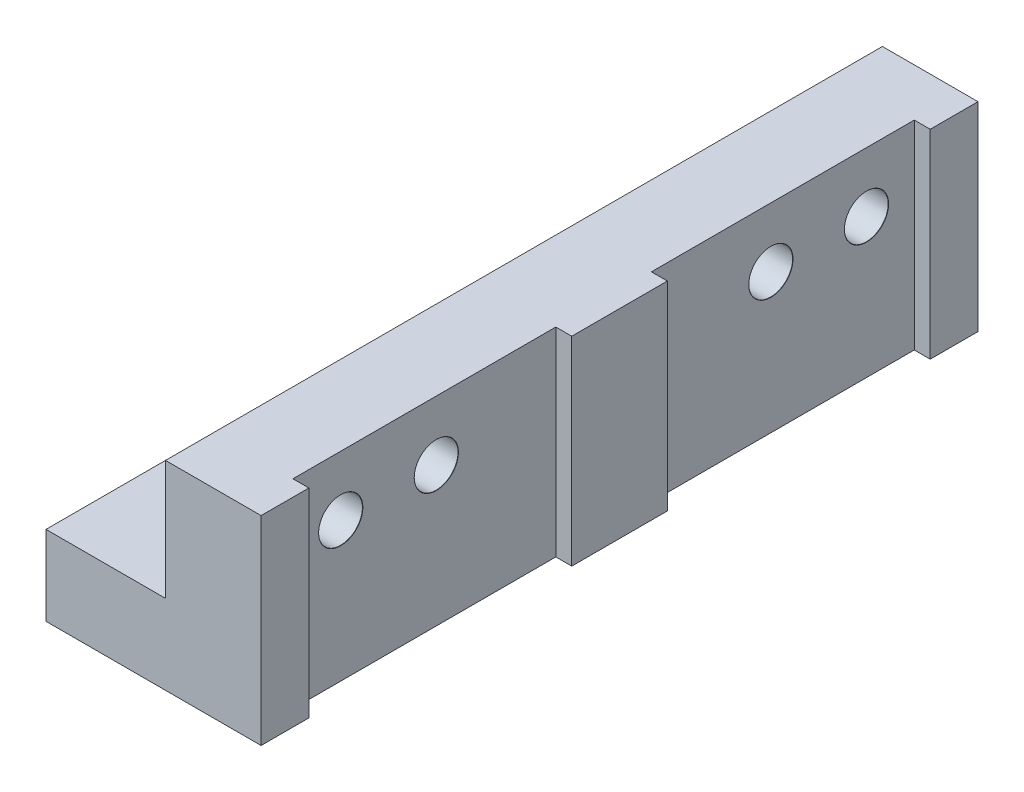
ISO-10303-21;
HEADER;
FILE_DESCRIPTION(('STEP AP214'),'2;1');
FILE_NAME('part.step','',(''),(''),'','','');
FILE_SCHEMA(('AUTOMOTIVE_DESIGN { 1 0 10303 214 1 1 1 1 }'));
ENDSEC;
DATA;
#1=APPLICATION_CONTEXT('core data for automotive mechanical design processes');
#2=APPLICATION_PROTOCOL_DEFINITION('international standard','automotive_design',2000,#1);
#3=PRODUCT_CONTEXT('',#1,'mechanical');
#4=PRODUCT('Part','Part','',(#3));
#5=PRODUCT_RELATED_PRODUCT_CATEGORY('part','',(#4));
#6=PRODUCT_DEFINITION_FORMATION('','',#4);
#7=PRODUCT_DEFINITION_CONTEXT('part definition',#1,'design');
#8=PRODUCT_DEFINITION('design','',#6,#7);
#9=PRODUCT_DEFINITION_SHAPE('','',#8);
#10=(LENGTH_UNIT() NAMED_UNIT(*) SI_UNIT(.MILLI.,.METRE.));
#11=(NAMED_UNIT(*) PLANE_ANGLE_UNIT() SI_UNIT($,.RADIAN.));
#12=(NAMED_UNIT(*) SI_UNIT($,.STERADIAN.) SOLID_ANGLE_UNIT());
#13=UNCERTAINTY_MEASURE_WITH_UNIT(LENGTH_MEASURE(1.E-05),#10,'distance_accuracy_value','');
#14=(GEOMETRIC_REPRESENTATION_CONTEXT(3) GLOBAL_UNCERTAINTY_ASSIGNED_CONTEXT((#13)) GLOBAL_UNIT_ASSIGNED_CONTEXT((#10,
#11,#12)) REPRESENTATION_CONTEXT('',''));
#15=CARTESIAN_POINT('',(0.,0.,0.));
#16=DIRECTION('',(0.,0.,1.));
#17=DIRECTION('',(1.,0.,0.));
#18=AXIS2_PLACEMENT_3D('',#15,#16,#17);
#19=CARTESIAN_POINT('',(148.,0.,-90.));
#20=DIRECTION('',(1.,0.,0.));
#21=DIRECTION('',(0.,0.,-1.));
#22=AXIS2_PLACEMENT_3D('',#19,#20,#21);
#23=PLANE('',#22);
#24=CARTESIAN_POINT('',(148.,17.5,-78.));
#25=DIRECTION('',(-1.,0.,0.));
#26=DIRECTION('',(0.,0.,1.));
#27=AXIS2_PLACEMENT_3D('',#24,#25,#26);
#28=CIRCLE('',#27,2.775);
#29=CARTESIAN_POINT('',(148.,17.5,-75.225));
#30=VERTEX_POINT('',#29);
#31=EDGE_CURVE('E268',#30,#30,#28,.T.);
#32=ORIENTED_EDGE('',*,*,#31,.T.);
#33=EDGE_LOOP('',(#32));
#34=FACE_BOUND('',#33,.T.);
#35=CARTESIAN_POINT('',(148.,17.5,-66.));
#36=DIRECTION('',(-1.,0.,0.));
#37=DIRECTION('',(0.,0.,1.));
#38=AXIS2_PLACEMENT_3D('',#35,#36,#37);
#39=CIRCLE('',#38,2.775);
#40=CARTESIAN_POINT('',(148.,17.5,-63.225));
#41=VERTEX_POINT('',#40);
#42=EDGE_CURVE('E271',#41,#41,#39,.T.);
#43=ORIENTED_EDGE('',*,*,#42,.T.);
#44=EDGE_LOOP('',(#43));
#45=FACE_BOUND('',#44,.T.);
#46=DIRECTION('',(0.,1.,0.));
#47=VECTOR('',#46,1.);
#48=CARTESIAN_POINT('',(148.,0.,-51.));
#49=LINE('',#48,#47);
#50=CARTESIAN_POINT('',(148.,0.,-51.));
#51=VERTEX_POINT('',#50);
#52=CARTESIAN_POINT('',(148.,25.,-51.));
#53=VERTEX_POINT('',#52);
#54=EDGE_CURVE('E40',#51,#53,#49,.T.);
#55=ORIENTED_EDGE('',*,*,#54,.F.);
#56=DIRECTION('',(0.,0.,1.));
#57=VECTOR('',#56,1.);
#58=CARTESIAN_POINT('',(148.,0.,-90.));
#59=LINE('',#58,#57);
#60=CARTESIAN_POINT('',(148.,0.,-84.));
#61=VERTEX_POINT('',#60);
#62=EDGE_CURVE('E11',#61,#51,#59,.T.);
#63=ORIENTED_EDGE('',*,*,#62,.F.);
#64=DIRECTION('',(0.,1.,0.));
#65=VECTOR('',#64,1.);
#66=CARTESIAN_POINT('',(148.,0.,-84.));
#67=LINE('',#66,#65);
#68=CARTESIAN_POINT('',(148.,25.,-84.));
#69=VERTEX_POINT('',#68);
#70=EDGE_CURVE('E187',#61,#69,#67,.T.);
#71=ORIENTED_EDGE('',*,*,#70,.T.);
#72=DIRECTION('',(0.,0.,1.));
#73=VECTOR('',#72,1.);
#74=CARTESIAN_POINT('',(148.,25.,-90.));
#75=LINE('',#74,#73);
#76=EDGE_CURVE('E213',#69,#53,#75,.T.);
#77=ORIENTED_EDGE('',*,*,#76,.T.);
#78=EDGE_LOOP('',(#55,#63,#71,#77));
#79=FACE_BOUND('',#78,.T.);
#80=ADVANCED_FACE('F16',(#34,#45,#79),#23,.T.);
#81=CARTESIAN_POINT('',(148.,17.5,-12.));
#82=DIRECTION('',(-1.,0.,0.));
#83=DIRECTION('',(0.,0.,1.));
#84=AXIS2_PLACEMENT_3D('',#81,#82,#83);
#85=CIRCLE('',#84,2.775);
#86=CARTESIAN_POINT('',(148.,17.5,-9.225));
#87=VERTEX_POINT('',#86);
#88=EDGE_CURVE('E298',#87,#87,#85,.T.);
#89=ORIENTED_EDGE('',*,*,#88,.T.);
#90=EDGE_LOOP('',(#89));
#91=FACE_BOUND('',#90,.T.);
#92=CARTESIAN_POINT('',(148.,17.5,-24.));
#93=DIRECTION('',(-1.,0.,0.));
#94=DIRECTION('',(0.,0.,1.));
#95=AXIS2_PLACEMENT_3D('',#92,#93,#94);
#96=CIRCLE('',#95,2.775);
#97=CARTESIAN_POINT('',(148.,17.5,-21.225));
#98=VERTEX_POINT('',#97);
#99=EDGE_CURVE('E319',#98,#98,#96,.T.);
#100=ORIENTED_EDGE('',*,*,#99,.T.);
#101=EDGE_LOOP('',(#100));
#102=FACE_BOUND('',#101,.T.);
#103=DIRECTION('',(0.,1.,0.));
#104=VECTOR('',#103,1.);
#105=CARTESIAN_POINT('',(148.,0.,-6.));
#106=LINE('',#105,#104);
#107=CARTESIAN_POINT('',(148.,0.,-6.));
#108=VERTEX_POINT('',#107);
#109=CARTESIAN_POINT('',(148.,25.,-6.));
#110=VERTEX_POINT('',#109);
#111=EDGE_CURVE('E155',#108,#110,#106,.T.);
#112=ORIENTED_EDGE('',*,*,#111,.F.);
#113=CARTESIAN_POINT('',(148.,0.,-39.));
#114=VERTEX_POINT('',#113);
#115=EDGE_CURVE('E20',#114,#108,#59,.T.);
#116=ORIENTED_EDGE('',*,*,#115,.F.);
#117=DIRECTION('',(0.,1.,0.));
#118=VECTOR('',#117,1.);
#119=CARTESIAN_POINT('',(148.,0.,-39.));
#120=LINE('',#119,#118);
#121=CARTESIAN_POINT('',(148.,25.,-39.));
#122=VERTEX_POINT('',#121);
#123=EDGE_CURVE('E169',#114,#122,#120,.T.);
#124=ORIENTED_EDGE('',*,*,#123,.T.);
#125=EDGE_CURVE('E210',#122,#110,#75,.T.);
#126=ORIENTED_EDGE('',*,*,#125,.T.);
#127=EDGE_LOOP('',(#112,#116,#124,#126));
#128=FACE_BOUND('',#127,.T.);
#129=ADVANCED_FACE('F18',(#91,#102,#128),#23,.T.);
#130=CARTESIAN_POINT('',(148.,0.,-90.));
#131=DIRECTION('',(0.,-1.,0.));
#132=DIRECTION('',(1.,0.,0.));
#133=AXIS2_PLACEMENT_3D('',#130,#131,#132);
#134=PLANE('',#133);
#135=CARTESIAN_POINT('',(130.5,0.,-70.));
#136=DIRECTION('',(0.,1.,0.));
#137=DIRECTION('',(0.,0.,1.));
#138=AXIS2_PLACEMENT_3D('',#135,#136,#137);
#139=CIRCLE('',#138,2.775);
#140=CARTESIAN_POINT('',(130.5,0.,-67.225));
#141=VERTEX_POINT('',#140);
#142=EDGE_CURVE('E340',#141,#141,#139,.T.);
#143=ORIENTED_EDGE('',*,*,#142,.T.);
#144=EDGE_LOOP('',(#143));
#145=FACE_BOUND('',#144,.T.);
#146=CARTESIAN_POINT('',(130.5,0.,-45.));
#147=DIRECTION('',(0.,1.,0.));
#148=DIRECTION('',(0.,0.,1.));
#149=AXIS2_PLACEMENT_3D('',#146,#147,#148);
#150=CIRCLE('',#149,2.775);
#151=CARTESIAN_POINT('',(130.5,0.,-42.225));
#152=VERTEX_POINT('',#151);
#153=EDGE_CURVE('E361',#152,#152,#150,.T.);
#154=ORIENTED_EDGE('',*,*,#153,.T.);
#155=EDGE_LOOP('',(#154));
#156=FACE_BOUND('',#155,.T.);
#157=CARTESIAN_POINT('',(130.5,0.,-20.));
#158=DIRECTION('',(0.,1.,0.));
#159=DIRECTION('',(0.,0.,1.));
#160=AXIS2_PLACEMENT_3D('',#157,#158,#159);
#161=CIRCLE('',#160,2.775);
#162=CARTESIAN_POINT('',(130.5,0.,-17.225));
#163=VERTEX_POINT('',#162);
#164=EDGE_CURVE('E382',#163,#163,#161,.T.);
#165=ORIENTED_EDGE('',*,*,#164,.T.);
#166=EDGE_LOOP('',(#165));
#167=FACE_BOUND('',#166,.T.);
#168=DIRECTION('',(1.,0.,0.));
#169=VECTOR('',#168,1.);
#170=CARTESIAN_POINT('',(148.,0.,0.));
#171=LINE('',#170,#169);
#172=CARTESIAN_POINT('',(123.,0.,0.));
#173=VERTEX_POINT('',#172);
#174=CARTESIAN_POINT('',(150.,0.,0.));
#175=VERTEX_POINT('',#174);
#176=EDGE_CURVE('E121',#173,#175,#171,.T.);
#177=ORIENTED_EDGE('',*,*,#176,.F.);
#178=DIRECTION('',(0.,0.,1.));
#179=VECTOR('',#178,1.);
#180=CARTESIAN_POINT('',(123.,0.,-90.));
#181=LINE('',#180,#179);
#182=CARTESIAN_POINT('',(123.,0.,-90.));
#183=VERTEX_POINT('',#182);
#184=EDGE_CURVE('E626',#183,#173,#181,.T.);
#185=ORIENTED_EDGE('',*,*,#184,.F.);
#186=DIRECTION('',(1.,0.,0.));
#187=VECTOR('',#186,1.);
#188=CARTESIAN_POINT('',(148.,0.,-90.));
#189=LINE('',#188,#187);
#190=CARTESIAN_POINT('',(150.,0.,-90.));
#191=VERTEX_POINT('',#190);
#192=EDGE_CURVE('E214',#183,#191,#189,.T.);
#193=ORIENTED_EDGE('',*,*,#192,.T.);
#194=DIRECTION('',(0.,0.,-1.));
#195=VECTOR('',#194,1.);
#196=CARTESIAN_POINT('',(150.,0.,-90.));
#197=LINE('',#196,#195);
#198=CARTESIAN_POINT('',(150.,0.,-84.));
#199=VERTEX_POINT('',#198);
#200=EDGE_CURVE('E184',#199,#191,#197,.T.);
#201=ORIENTED_EDGE('',*,*,#200,.F.);
#202=DIRECTION('',(1.,0.,0.));
#203=VECTOR('',#202,1.);
#204=CARTESIAN_POINT('',(148.,0.,-84.));
#205=LINE('',#204,#203);
#206=EDGE_CURVE('E188',#61,#199,#205,.T.);
#207=ORIENTED_EDGE('',*,*,#206,.F.);
#208=ORIENTED_EDGE('',*,*,#62,.T.);
#209=DIRECTION('',(-1.,0.,0.));
#210=VECTOR('',#209,1.);
#211=CARTESIAN_POINT('',(148.,0.,-51.));
#212=LINE('',#211,#210);
#213=CARTESIAN_POINT('',(150.,0.,-51.));
#214=VERTEX_POINT('',#213);
#215=EDGE_CURVE('E166',#214,#51,#212,.T.);
#216=ORIENTED_EDGE('',*,*,#215,.F.);
#217=DIRECTION('',(0.,0.,-1.));
#218=VECTOR('',#217,1.);
#219=CARTESIAN_POINT('',(150.,0.,-51.));
#220=LINE('',#219,#218);
#221=CARTESIAN_POINT('',(150.,0.,-39.));
#222=VERTEX_POINT('',#221);
#223=EDGE_CURVE('E162',#222,#214,#220,.T.);
#224=ORIENTED_EDGE('',*,*,#223,.F.);
#225=DIRECTION('',(1.,0.,0.));
#226=VECTOR('',#225,1.);
#227=CARTESIAN_POINT('',(148.,0.,-39.));
#228=LINE('',#227,#226);
#229=EDGE_CURVE('E159',#114,#222,#228,.T.);
#230=ORIENTED_EDGE('',*,*,#229,.F.);
#231=ORIENTED_EDGE('',*,*,#115,.T.);
#232=DIRECTION('',(-1.,0.,0.));
#233=VECTOR('',#232,1.);
#234=CARTESIAN_POINT('',(148.,0.,-6.));
#235=LINE('',#234,#233);
#236=CARTESIAN_POINT('',(150.,0.,-6.));
#237=VERTEX_POINT('',#236);
#238=EDGE_CURVE('E142',#237,#108,#235,.T.);
#239=ORIENTED_EDGE('',*,*,#238,.F.);
#240=DIRECTION('',(0.,0.,-1.));
#241=VECTOR('',#240,1.);
#242=CARTESIAN_POINT('',(150.,0.,0.));
#243=LINE('',#242,#241);
#244=EDGE_CURVE('E137',#175,#237,#243,.T.);
#245=ORIENTED_EDGE('',*,*,#244,.F.);
#246=EDGE_LOOP('',(#177,#185,#193,#201,#207,#208,#216,#224,#230,#231,#239,#245));
#247=FACE_BOUND('',#246,.T.);
#248=ADVANCED_FACE('F144',(#145,#156,#167,#247),#134,.T.);
#249=CARTESIAN_POINT('',(123.,0.,-90.));
#250=DIRECTION('',(-1.,0.,0.));
#251=DIRECTION('',(0.,0.,1.));
#252=AXIS2_PLACEMENT_3D('',#249,#250,#251);
#253=PLANE('',#252);
#254=DIRECTION('',(0.,-1.,0.));
#255=VECTOR('',#254,1.);
#256=CARTESIAN_POINT('',(123.,0.,0.));
#257=LINE('',#256,#255);
#258=CARTESIAN_POINT('',(123.,10.,0.));
#259=VERTEX_POINT('',#258);
#260=EDGE_CURVE('E129',#259,#173,#257,.T.);
#261=ORIENTED_EDGE('',*,*,#260,.F.);
#262=DIRECTION('',(0.,0.,1.));
#263=VECTOR('',#262,1.);
#264=CARTESIAN_POINT('',(123.,10.,-90.));
#265=LINE('',#264,#263);
#266=CARTESIAN_POINT('',(123.,10.,-90.));
#267=VERTEX_POINT('',#266);
#268=EDGE_CURVE('E629',#267,#259,#265,.T.);
#269=ORIENTED_EDGE('',*,*,#268,.F.);
#270=DIRECTION('',(0.,-1.,0.));
#271=VECTOR('',#270,1.);
#272=CARTESIAN_POINT('',(123.,0.,-90.));
#273=LINE('',#272,#271);
#274=EDGE_CURVE('E635',#267,#183,#273,.T.);
#275=ORIENTED_EDGE('',*,*,#274,.T.);
#276=ORIENTED_EDGE('',*,*,#184,.T.);
#277=EDGE_LOOP('',(#261,#269,#275,#276));
#278=FACE_BOUND('',#277,.T.);
#279=ADVANCED_FACE('F659',(#278),#253,.T.);
#280=CARTESIAN_POINT('',(138.,10.,-90.));
#281=DIRECTION('',(0.,1.,0.));
#282=DIRECTION('',(0.,0.,1.));
#283=AXIS2_PLACEMENT_3D('',#280,#281,#282);
#284=PLANE('',#283);
#285=CARTESIAN_POINT('',(130.5,10.,-70.));
#286=DIRECTION('',(0.,1.,0.));
#287=DIRECTION('',(0.,0.,1.));
#288=AXIS2_PLACEMENT_3D('',#285,#286,#287);
#289=CIRCLE('',#288,5.025);
#290=CARTESIAN_POINT('',(130.5,10.,-64.975));
#291=VERTEX_POINT('',#290);
#292=EDGE_CURVE('E343',#291,#291,#289,.T.);
#293=ORIENTED_EDGE('',*,*,#292,.F.);
#294=EDGE_LOOP('',(#293));
#295=FACE_BOUND('',#294,.T.);
#296=CARTESIAN_POINT('',(130.5,10.,-45.));
#297=DIRECTION('',(0.,1.,0.));
#298=DIRECTION('',(0.,0.,1.));
#299=AXIS2_PLACEMENT_3D('',#296,#297,#298);
#300=CIRCLE('',#299,5.025);
#301=CARTESIAN_POINT('',(130.5,10.,-39.975));
#302=VERTEX_POINT('',#301);
#303=EDGE_CURVE('E364',#302,#302,#300,.T.);
#304=ORIENTED_EDGE('',*,*,#303,.F.);
#305=EDGE_LOOP('',(#304));
#306=FACE_BOUND('',#305,.T.);
#307=CARTESIAN_POINT('',(130.5,10.,-20.));
#308=DIRECTION('',(0.,1.,0.));
#309=DIRECTION('',(0.,0.,1.));
#310=AXIS2_PLACEMENT_3D('',#307,#308,#309);
#311=CIRCLE('',#310,5.025);
#312=CARTESIAN_POINT('',(130.5,10.,-14.975));
#313=VERTEX_POINT('',#312);
#314=EDGE_CURVE('E385',#313,#313,#311,.T.);
#315=ORIENTED_EDGE('',*,*,#314,.F.);
#316=EDGE_LOOP('',(#315));
#317=FACE_BOUND('',#316,.T.);
#318=DIRECTION('',(-1.,0.,0.));
#319=VECTOR('',#318,1.);
#320=CARTESIAN_POINT('',(138.,10.,0.));
#321=LINE('',#320,#319);
#322=CARTESIAN_POINT('',(138.,10.,0.));
#323=VERTEX_POINT('',#322);
#324=EDGE_CURVE('E617',#323,#259,#321,.T.);
#325=ORIENTED_EDGE('',*,*,#324,.F.);
#326=DIRECTION('',(0.,0.,1.));
#327=VECTOR('',#326,1.);
#328=CARTESIAN_POINT('',(138.,10.,-90.));
#329=LINE('',#328,#327);
#330=CARTESIAN_POINT('',(138.,10.,-90.));
#331=VERTEX_POINT('',#330);
#332=EDGE_CURVE('E615',#331,#323,#329,.T.);
#333=ORIENTED_EDGE('',*,*,#332,.F.);
#334=DIRECTION('',(-1.,0.,0.));
#335=VECTOR('',#334,1.);
#336=CARTESIAN_POINT('',(138.,10.,-90.));
#337=LINE('',#336,#335);
#338=EDGE_CURVE('E633',#331,#267,#337,.T.);
#339=ORIENTED_EDGE('',*,*,#338,.T.);
#340=ORIENTED_EDGE('',*,*,#268,.T.);
#341=EDGE_LOOP('',(#325,#333,#339,#340));
#342=FACE_BOUND('',#341,.T.);
#343=ADVANCED_FACE('F602',(#295,#306,#317,#342),#284,.T.);
#344=CARTESIAN_POINT('',(138.,10.,-90.));
#345=DIRECTION('',(-1.,0.,0.));
#346=DIRECTION('',(0.,0.,1.));
#347=AXIS2_PLACEMENT_3D('',#344,#345,#346);
#348=PLANE('',#347);
#349=CARTESIAN_POINT('',(138.,17.5,-78.));
#350=DIRECTION('',(-1.,0.,0.));
#351=DIRECTION('',(0.,0.,1.));
#352=AXIS2_PLACEMENT_3D('',#349,#350,#351);
#353=CIRCLE('',#352,5.025);
#354=CARTESIAN_POINT('',(138.,17.5,-72.975));
#355=VERTEX_POINT('',#354);
#356=EDGE_CURVE('E580',#355,#355,#353,.T.);
#357=ORIENTED_EDGE('',*,*,#356,.F.);
#358=EDGE_LOOP('',(#357));
#359=FACE_BOUND('',#358,.T.);
#360=CARTESIAN_POINT('',(138.,17.5,-66.));
#361=DIRECTION('',(-1.,0.,0.));
#362=DIRECTION('',(0.,0.,1.));
#363=AXIS2_PLACEMENT_3D('',#360,#361,#362);
#364=CIRCLE('',#363,5.025);
#365=CARTESIAN_POINT('',(138.,17.5,-60.975));
#366=VERTEX_POINT('',#365);
#367=EDGE_CURVE('E273',#366,#366,#364,.T.);
#368=ORIENTED_EDGE('',*,*,#367,.F.);
#369=EDGE_LOOP('',(#368));
#370=FACE_BOUND('',#369,.T.);
#371=CARTESIAN_POINT('',(138.,17.5,-12.));
#372=DIRECTION('',(-1.,0.,0.));
#373=DIRECTION('',(0.,0.,1.));
#374=AXIS2_PLACEMENT_3D('',#371,#372,#373);
#375=CIRCLE('',#374,5.025);
#376=CARTESIAN_POINT('',(138.,17.5,-6.975));
#377=VERTEX_POINT('',#376);
#378=EDGE_CURVE('E301',#377,#377,#375,.T.);
#379=ORIENTED_EDGE('',*,*,#378,.F.);
#380=EDGE_LOOP('',(#379));
#381=FACE_BOUND('',#380,.T.);
#382=CARTESIAN_POINT('',(138.,17.5,-24.));
#383=DIRECTION('',(-1.,0.,0.));
#384=DIRECTION('',(0.,0.,1.));
#385=AXIS2_PLACEMENT_3D('',#382,#383,#384);
#386=CIRCLE('',#385,5.025);
#387=CARTESIAN_POINT('',(138.,17.5,-18.975));
#388=VERTEX_POINT('',#387);
#389=EDGE_CURVE('E322',#388,#388,#386,.T.);
#390=ORIENTED_EDGE('',*,*,#389,.F.);
#391=EDGE_LOOP('',(#390));
#392=FACE_BOUND('',#391,.T.);
#393=DIRECTION('',(0.,-1.,0.));
#394=VECTOR('',#393,1.);
#395=CARTESIAN_POINT('',(138.,10.,0.));
#396=LINE('',#395,#394);
#397=CARTESIAN_POINT('',(138.,25.,0.));
#398=VERTEX_POINT('',#397);
#399=EDGE_CURVE('E612',#398,#323,#396,.T.);
#400=ORIENTED_EDGE('',*,*,#399,.F.);
#401=DIRECTION('',(0.,0.,1.));
#402=VECTOR('',#401,1.);
#403=CARTESIAN_POINT('',(138.,25.,-90.));
#404=LINE('',#403,#402);
#405=CARTESIAN_POINT('',(138.,25.,-90.));
#406=VERTEX_POINT('',#405);
#407=EDGE_CURVE('E217',#406,#398,#404,.T.);
#408=ORIENTED_EDGE('',*,*,#407,.F.);
#409=DIRECTION('',(0.,-1.,0.));
#410=VECTOR('',#409,1.);
#411=CARTESIAN_POINT('',(138.,10.,-90.));
#412=LINE('',#411,#410);
#413=EDGE_CURVE('E632',#406,#331,#412,.T.);
#414=ORIENTED_EDGE('',*,*,#413,.T.);
#415=ORIENTED_EDGE('',*,*,#332,.T.);
#416=EDGE_LOOP('',(#400,#408,#414,#415));
#417=FACE_BOUND('',#416,.T.);
#418=ADVANCED_FACE('F599',(#359,#370,#381,#392,#417),#348,.T.);
#419=CARTESIAN_POINT('',(148.,25.,-90.));
#420=DIRECTION('',(0.,1.,0.));
#421=DIRECTION('',(-1.,0.,0.));
#422=AXIS2_PLACEMENT_3D('',#419,#420,#421);
#423=PLANE('',#422);
#424=DIRECTION('',(-1.,0.,0.));
#425=VECTOR('',#424,1.);
#426=CARTESIAN_POINT('',(148.,25.,0.));
#427=LINE('',#426,#425);
#428=CARTESIAN_POINT('',(150.,25.,0.));
#429=VERTEX_POINT('',#428);
#430=EDGE_CURVE('E195',#429,#398,#427,.T.);
#431=ORIENTED_EDGE('',*,*,#430,.F.);
#432=DIRECTION('',(0.,0.,-1.));
#433=VECTOR('',#432,1.);
#434=CARTESIAN_POINT('',(150.,25.,0.));
#435=LINE('',#434,#433);
#436=CARTESIAN_POINT('',(150.,25.,-6.));
#437=VERTEX_POINT('',#436);
#438=EDGE_CURVE('E140',#429,#437,#435,.T.);
#439=ORIENTED_EDGE('',*,*,#438,.T.);
#440=DIRECTION('',(-1.,0.,0.));
#441=VECTOR('',#440,1.);
#442=CARTESIAN_POINT('',(148.,25.,-6.));
#443=LINE('',#442,#441);
#444=EDGE_CURVE('E145',#437,#110,#443,.T.);
#445=ORIENTED_EDGE('',*,*,#444,.T.);
#446=ORIENTED_EDGE('',*,*,#125,.F.);
#447=DIRECTION('',(1.,0.,0.));
#448=VECTOR('',#447,1.);
#449=CARTESIAN_POINT('',(148.,25.,-39.));
#450=LINE('',#449,#448);
#451=CARTESIAN_POINT('',(150.,25.,-39.));
#452=VERTEX_POINT('',#451);
#453=EDGE_CURVE('E157',#122,#452,#450,.T.);
#454=ORIENTED_EDGE('',*,*,#453,.T.);
#455=DIRECTION('',(0.,0.,-1.));
#456=VECTOR('',#455,1.);
#457=CARTESIAN_POINT('',(150.,25.,-51.));
#458=LINE('',#457,#456);
#459=CARTESIAN_POINT('',(150.,25.,-51.));
#460=VERTEX_POINT('',#459);
#461=EDGE_CURVE('E172',#452,#460,#458,.T.);
#462=ORIENTED_EDGE('',*,*,#461,.T.);
#463=DIRECTION('',(-1.,0.,0.));
#464=VECTOR('',#463,1.);
#465=CARTESIAN_POINT('',(148.,25.,-51.));
#466=LINE('',#465,#464);
#467=EDGE_CURVE('E163',#460,#53,#466,.T.);
#468=ORIENTED_EDGE('',*,*,#467,.T.);
#469=ORIENTED_EDGE('',*,*,#76,.F.);
#470=DIRECTION('',(1.,0.,0.));
#471=VECTOR('',#470,1.);
#472=CARTESIAN_POINT('',(148.,25.,-84.));
#473=LINE('',#472,#471);
#474=CARTESIAN_POINT('',(150.,25.,-84.));
#475=VERTEX_POINT('',#474);
#476=EDGE_CURVE('E178',#69,#475,#473,.T.);
#477=ORIENTED_EDGE('',*,*,#476,.T.);
#478=DIRECTION('',(0.,0.,-1.));
#479=VECTOR('',#478,1.);
#480=CARTESIAN_POINT('',(150.,25.,-90.));
#481=LINE('',#480,#479);
#482=CARTESIAN_POINT('',(150.,25.,-90.));
#483=VERTEX_POINT('',#482);
#484=EDGE_CURVE('E189',#475,#483,#481,.T.);
#485=ORIENTED_EDGE('',*,*,#484,.T.);
#486=DIRECTION('',(-1.,0.,0.));
#487=VECTOR('',#486,1.);
#488=CARTESIAN_POINT('',(148.,25.,-90.));
#489=LINE('',#488,#487);
#490=EDGE_CURVE('E132',#483,#406,#489,.T.);
#491=ORIENTED_EDGE('',*,*,#490,.T.);
#492=ORIENTED_EDGE('',*,*,#407,.T.);
#493=EDGE_LOOP('',(#431,#439,#445,#446,#454,#462,#468,#469,#477,#485,#491,#492));
#494=FACE_BOUND('',#493,.T.);
#495=ADVANCED_FACE('F224',(#494),#423,.T.);
#496=CARTESIAN_POINT('',(0.,0.,-90.));
#497=DIRECTION('',(0.,0.,1.));
#498=DIRECTION('',(1.,0.,0.));
#499=AXIS2_PLACEMENT_3D('',#496,#497,#498);
#500=PLANE('',#499);
#501=ORIENTED_EDGE('',*,*,#490,.F.);
#502=DIRECTION('',(0.,1.,0.));
#503=VECTOR('',#502,1.);
#504=CARTESIAN_POINT('',(150.,0.,-90.));
#505=LINE('',#504,#503);
#506=EDGE_CURVE('E192',#191,#483,#505,.T.);
#507=ORIENTED_EDGE('',*,*,#506,.F.);
#508=ORIENTED_EDGE('',*,*,#192,.F.);
#509=ORIENTED_EDGE('',*,*,#274,.F.);
#510=ORIENTED_EDGE('',*,*,#338,.F.);
#511=ORIENTED_EDGE('',*,*,#413,.F.);
#512=EDGE_LOOP('',(#501,#507,#508,#509,#510,#511));
#513=FACE_BOUND('',#512,.T.);
#514=ADVANCED_FACE('F641',(#513),#500,.F.);
#515=CARTESIAN_POINT('',(0.,0.,0.));
#516=DIRECTION('',(0.,0.,1.));
#517=DIRECTION('',(1.,0.,0.));
#518=AXIS2_PLACEMENT_3D('',#515,#516,#517);
#519=PLANE('',#518);
#520=ORIENTED_EDGE('',*,*,#176,.T.);
#521=DIRECTION('',(0.,1.,0.));
#522=VECTOR('',#521,1.);
#523=CARTESIAN_POINT('',(150.,0.,0.));
#524=LINE('',#523,#522);
#525=EDGE_CURVE('E125',#175,#429,#524,.T.);
#526=ORIENTED_EDGE('',*,*,#525,.T.);
#527=ORIENTED_EDGE('',*,*,#430,.T.);
#528=ORIENTED_EDGE('',*,*,#399,.T.);
#529=ORIENTED_EDGE('',*,*,#324,.T.);
#530=ORIENTED_EDGE('',*,*,#260,.T.);
#531=EDGE_LOOP('',(#520,#526,#527,#528,#529,#530));
#532=FACE_BOUND('',#531,.T.);
#533=ADVANCED_FACE('F123',(#532),#519,.T.);
#534=CARTESIAN_POINT('',(150.,0.,-90.));
#535=DIRECTION('',(1.,0.,0.));
#536=DIRECTION('',(0.,1.,0.));
#537=AXIS2_PLACEMENT_3D('',#534,#535,#536);
#538=PLANE('',#537);
#539=ORIENTED_EDGE('',*,*,#484,.F.);
#540=DIRECTION('',(0.,1.,0.));
#541=VECTOR('',#540,1.);
#542=CARTESIAN_POINT('',(150.,0.,-84.));
#543=LINE('',#542,#541);
#544=EDGE_CURVE('E196',#199,#475,#543,.T.);
#545=ORIENTED_EDGE('',*,*,#544,.F.);
#546=ORIENTED_EDGE('',*,*,#200,.T.);
#547=ORIENTED_EDGE('',*,*,#506,.T.);
#548=EDGE_LOOP('',(#539,#545,#546,#547));
#549=FACE_BOUND('',#548,.T.);
#550=ADVANCED_FACE('F643',(#549),#538,.T.);
#551=CARTESIAN_POINT('',(148.,0.,-84.));
#552=DIRECTION('',(0.,0.,1.));
#553=DIRECTION('',(1.,0.,0.));
#554=AXIS2_PLACEMENT_3D('',#551,#552,#553);
#555=PLANE('',#554);
#556=ORIENTED_EDGE('',*,*,#476,.F.);
#557=ORIENTED_EDGE('',*,*,#70,.F.);
#558=ORIENTED_EDGE('',*,*,#206,.T.);
#559=ORIENTED_EDGE('',*,*,#544,.T.);
#560=EDGE_LOOP('',(#556,#557,#558,#559));
#561=FACE_BOUND('',#560,.T.);
#562=ADVANCED_FACE('F228',(#561),#555,.T.);
#563=CARTESIAN_POINT('',(148.,0.,-51.));
#564=DIRECTION('',(0.,0.,-1.));
#565=DIRECTION('',(-1.,0.,0.));
#566=AXIS2_PLACEMENT_3D('',#563,#564,#565);
#567=PLANE('',#566);
#568=ORIENTED_EDGE('',*,*,#467,.F.);
#569=DIRECTION('',(0.,1.,0.));
#570=VECTOR('',#569,1.);
#571=CARTESIAN_POINT('',(150.,0.,-51.));
#572=LINE('',#571,#570);
#573=EDGE_CURVE('E179',#214,#460,#572,.T.);
#574=ORIENTED_EDGE('',*,*,#573,.F.);
#575=ORIENTED_EDGE('',*,*,#215,.T.);
#576=ORIENTED_EDGE('',*,*,#54,.T.);
#577=EDGE_LOOP('',(#568,#574,#575,#576));
#578=FACE_BOUND('',#577,.T.);
#579=ADVANCED_FACE('F235',(#578),#567,.T.);
#580=CARTESIAN_POINT('',(150.,0.,-51.));
#581=DIRECTION('',(1.,0.,0.));
#582=DIRECTION('',(0.,1.,0.));
#583=AXIS2_PLACEMENT_3D('',#580,#581,#582);
#584=PLANE('',#583);
#585=ORIENTED_EDGE('',*,*,#461,.F.);
#586=DIRECTION('',(0.,1.,0.));
#587=VECTOR('',#586,1.);
#588=CARTESIAN_POINT('',(150.,0.,-39.));
#589=LINE('',#588,#587);
#590=EDGE_CURVE('E181',#222,#452,#589,.T.);
#591=ORIENTED_EDGE('',*,*,#590,.F.);
#592=ORIENTED_EDGE('',*,*,#223,.T.);
#593=ORIENTED_EDGE('',*,*,#573,.T.);
#594=EDGE_LOOP('',(#585,#591,#592,#593));
#595=FACE_BOUND('',#594,.T.);
#596=ADVANCED_FACE('F238',(#595),#584,.T.);
#597=CARTESIAN_POINT('',(148.,0.,-39.));
#598=DIRECTION('',(0.,0.,1.));
#599=DIRECTION('',(1.,0.,0.));
#600=AXIS2_PLACEMENT_3D('',#597,#598,#599);
#601=PLANE('',#600);
#602=ORIENTED_EDGE('',*,*,#453,.F.);
#603=ORIENTED_EDGE('',*,*,#123,.F.);
#604=ORIENTED_EDGE('',*,*,#229,.T.);
#605=ORIENTED_EDGE('',*,*,#590,.T.);
#606=EDGE_LOOP('',(#602,#603,#604,#605));
#607=FACE_BOUND('',#606,.T.);
#608=ADVANCED_FACE('F242',(#607),#601,.T.);
#609=CARTESIAN_POINT('',(148.,0.,-6.));
#610=DIRECTION('',(0.,0.,-1.));
#611=DIRECTION('',(-1.,0.,0.));
#612=AXIS2_PLACEMENT_3D('',#609,#610,#611);
#613=PLANE('',#612);
#614=ORIENTED_EDGE('',*,*,#444,.F.);
#615=DIRECTION('',(0.,1.,0.));
#616=VECTOR('',#615,1.);
#617=CARTESIAN_POINT('',(150.,0.,-6.));
#618=LINE('',#617,#616);
#619=EDGE_CURVE('E141',#237,#437,#618,.T.);
#620=ORIENTED_EDGE('',*,*,#619,.F.);
#621=ORIENTED_EDGE('',*,*,#238,.T.);
#622=ORIENTED_EDGE('',*,*,#111,.T.);
#623=EDGE_LOOP('',(#614,#620,#621,#622));
#624=FACE_BOUND('',#623,.T.);
#625=ADVANCED_FACE('F245',(#624),#613,.T.);
#626=CARTESIAN_POINT('',(150.,0.,0.));
#627=DIRECTION('',(1.,0.,0.));
#628=DIRECTION('',(0.,1.,0.));
#629=AXIS2_PLACEMENT_3D('',#626,#627,#628);
#630=PLANE('',#629);
#631=ORIENTED_EDGE('',*,*,#438,.F.);
#632=ORIENTED_EDGE('',*,*,#525,.F.);
#633=ORIENTED_EDGE('',*,*,#244,.T.);
#634=ORIENTED_EDGE('',*,*,#619,.T.);
#635=EDGE_LOOP('',(#631,#632,#633,#634));
#636=FACE_BOUND('',#635,.T.);
#637=ADVANCED_FACE('F136',(#636),#630,.T.);
#638=CARTESIAN_POINT('',(130.5,0.0249999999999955,-20.));
#639=DIRECTION('',(0.,-1.,0.));
#640=DIRECTION('',(0.,0.,-1.));
#641=AXIS2_PLACEMENT_3D('',#638,#639,#640);
#642=CONICAL_SURFACE('',#641,2.75,0.785398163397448);
#643=ORIENTED_EDGE('',*,*,#164,.F.);
#644=EDGE_LOOP('',(#643));
#645=FACE_BOUND('',#644,.T.);
#646=CARTESIAN_POINT('',(130.5,0.0249999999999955,-20.));
#647=DIRECTION('',(0.,1.,0.));
#648=DIRECTION('',(0.,0.,1.));
#649=AXIS2_PLACEMENT_3D('',#646,#647,#648);
#650=CIRCLE('',#649,2.75);
#651=CARTESIAN_POINT('',(130.5,0.0249999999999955,-17.25));
#652=VERTEX_POINT('',#651);
#653=EDGE_CURVE('E151',#652,#652,#650,.T.);
#654=ORIENTED_EDGE('',*,*,#653,.T.);
#655=EDGE_LOOP('',(#654));
#656=FACE_BOUND('',#655,.T.);
#657=ADVANCED_FACE('F254',(#645,#656),#642,.F.);
#658=CARTESIAN_POINT('',(130.5,10.,-20.));
#659=DIRECTION('',(0.,1.,0.));
#660=DIRECTION('',(0.,0.,1.));
#661=AXIS2_PLACEMENT_3D('',#658,#659,#660);
#662=CYLINDRICAL_SURFACE('',#661,2.75);
#663=ORIENTED_EDGE('',*,*,#653,.F.);
#664=EDGE_LOOP('',(#663));
#665=FACE_BOUND('',#664,.T.);
#666=CARTESIAN_POINT('',(130.5,4.275,-20.));
#667=DIRECTION('',(0.,1.,0.));
#668=DIRECTION('',(0.,0.,1.));
#669=AXIS2_PLACEMENT_3D('',#666,#667,#668);
#670=CIRCLE('',#669,2.75);
#671=CARTESIAN_POINT('',(130.5,4.275,-17.25));
#672=VERTEX_POINT('',#671);
#673=EDGE_CURVE('E396',#672,#672,#670,.T.);
#674=ORIENTED_EDGE('',*,*,#673,.T.);
#675=EDGE_LOOP('',(#674));
#676=FACE_BOUND('',#675,.T.);
#677=ADVANCED_FACE('F404',(#665,#676),#662,.F.);
#678=CARTESIAN_POINT('',(130.5,4.3,-20.));
#679=DIRECTION('',(0.,1.,0.));
#680=DIRECTION('',(0.,0.,1.));
#681=AXIS2_PLACEMENT_3D('',#678,#679,#680);
#682=CONICAL_SURFACE('',#681,2.775,0.785398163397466);
#683=ORIENTED_EDGE('',*,*,#673,.F.);
#684=EDGE_LOOP('',(#683));
#685=FACE_BOUND('',#684,.T.);
#686=CARTESIAN_POINT('',(130.5,4.3,-20.));
#687=DIRECTION('',(0.,1.,0.));
#688=DIRECTION('',(0.,0.,1.));
#689=AXIS2_PLACEMENT_3D('',#686,#687,#688);
#690=CIRCLE('',#689,2.775);
#691=CARTESIAN_POINT('',(130.5,4.3,-17.225));
#692=VERTEX_POINT('',#691);
#693=EDGE_CURVE('E394',#692,#692,#690,.T.);
#694=ORIENTED_EDGE('',*,*,#693,.T.);
#695=EDGE_LOOP('',(#694));
#696=FACE_BOUND('',#695,.T.);
#697=ADVANCED_FACE('F406',(#685,#696),#682,.F.);
#698=CARTESIAN_POINT('',(133.275,4.3,-20.));
#699=DIRECTION('',(0.,-1.,0.));
#700=DIRECTION('',(0.,0.,-1.));
#701=AXIS2_PLACEMENT_3D('',#698,#699,#700);
#702=PLANE('',#701);
#703=ORIENTED_EDGE('',*,*,#693,.F.);
#704=EDGE_LOOP('',(#703));
#705=FACE_BOUND('',#704,.T.);
#706=CARTESIAN_POINT('',(130.5,4.3,-20.));
#707=DIRECTION('',(0.,1.,0.));
#708=DIRECTION('',(0.,0.,1.));
#709=AXIS2_PLACEMENT_3D('',#706,#707,#708);
#710=CIRCLE('',#709,5.);
#711=CARTESIAN_POINT('',(130.5,4.3,-15.));
#712=VERTEX_POINT('',#711);
#713=EDGE_CURVE('E391',#712,#712,#710,.T.);
#714=ORIENTED_EDGE('',*,*,#713,.T.);
#715=EDGE_LOOP('',(#714));
#716=FACE_BOUND('',#715,.T.);
#717=ADVANCED_FACE('F413',(#705,#716),#702,.F.);
#718=CARTESIAN_POINT('',(130.5,10.,-20.));
#719=DIRECTION('',(0.,1.,0.));
#720=DIRECTION('',(0.,0.,1.));
#721=AXIS2_PLACEMENT_3D('',#718,#719,#720);
#722=CYLINDRICAL_SURFACE('',#721,5.);
#723=ORIENTED_EDGE('',*,*,#713,.F.);
#724=EDGE_LOOP('',(#723));
#725=FACE_BOUND('',#724,.T.);
#726=CARTESIAN_POINT('',(130.5,9.975,-20.));
#727=DIRECTION('',(0.,1.,0.));
#728=DIRECTION('',(0.,0.,1.));
#729=AXIS2_PLACEMENT_3D('',#726,#727,#728);
#730=CIRCLE('',#729,5.);
#731=CARTESIAN_POINT('',(130.5,9.975,-15.));
#732=VERTEX_POINT('',#731);
#733=EDGE_CURVE('E388',#732,#732,#730,.T.);
#734=ORIENTED_EDGE('',*,*,#733,.T.);
#735=EDGE_LOOP('',(#734));
#736=FACE_BOUND('',#735,.T.);
#737=ADVANCED_FACE('F420',(#725,#736),#722,.F.);
#738=CARTESIAN_POINT('',(130.5,10.,-20.));
#739=DIRECTION('',(0.,1.,0.));
#740=DIRECTION('',(0.,0.,1.));
#741=AXIS2_PLACEMENT_3D('',#738,#739,#740);
#742=CONICAL_SURFACE('',#741,5.025,0.785398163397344);
#743=ORIENTED_EDGE('',*,*,#733,.F.);
#744=EDGE_LOOP('',(#743));
#745=FACE_BOUND('',#744,.T.);
#746=ORIENTED_EDGE('',*,*,#314,.T.);
#747=EDGE_LOOP('',(#746));
#748=FACE_BOUND('',#747,.T.);
#749=ADVANCED_FACE('F424',(#745,#748),#742,.F.);
#750=CARTESIAN_POINT('',(130.5,0.0249999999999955,-45.));
#751=DIRECTION('',(0.,-1.,0.));
#752=DIRECTION('',(0.,0.,-1.));
#753=AXIS2_PLACEMENT_3D('',#750,#751,#752);
#754=CONICAL_SURFACE('',#753,2.75,0.785398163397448);
#755=ORIENTED_EDGE('',*,*,#153,.F.);
#756=EDGE_LOOP('',(#755));
#757=FACE_BOUND('',#756,.T.);
#758=CARTESIAN_POINT('',(130.5,0.0249999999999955,-45.));
#759=DIRECTION('',(0.,1.,0.));
#760=DIRECTION('',(0.,0.,1.));
#761=AXIS2_PLACEMENT_3D('',#758,#759,#760);
#762=CIRCLE('',#761,2.75);
#763=CARTESIAN_POINT('',(130.5,0.0249999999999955,-42.25));
#764=VERTEX_POINT('',#763);
#765=EDGE_CURVE('E379',#764,#764,#762,.T.);
#766=ORIENTED_EDGE('',*,*,#765,.T.);
#767=EDGE_LOOP('',(#766));
#768=FACE_BOUND('',#767,.T.);
#769=ADVANCED_FACE('F428',(#757,#768),#754,.F.);
#770=CARTESIAN_POINT('',(130.5,10.,-45.));
#771=DIRECTION('',(0.,1.,0.));
#772=DIRECTION('',(0.,0.,1.));
#773=AXIS2_PLACEMENT_3D('',#770,#771,#772);
#774=CYLINDRICAL_SURFACE('',#773,2.75);
#775=ORIENTED_EDGE('',*,*,#765,.F.);
#776=EDGE_LOOP('',(#775));
#777=FACE_BOUND('',#776,.T.);
#778=CARTESIAN_POINT('',(130.5,4.275,-45.));
#779=DIRECTION('',(0.,1.,0.));
#780=DIRECTION('',(0.,0.,1.));
#781=AXIS2_PLACEMENT_3D('',#778,#779,#780);
#782=CIRCLE('',#781,2.75);
#783=CARTESIAN_POINT('',(130.5,4.275,-42.25));
#784=VERTEX_POINT('',#783);
#785=EDGE_CURVE('E376',#784,#784,#782,.T.);
#786=ORIENTED_EDGE('',*,*,#785,.T.);
#787=EDGE_LOOP('',(#786));
#788=FACE_BOUND('',#787,.T.);
#789=ADVANCED_FACE('F432',(#777,#788),#774,.F.);
#790=CARTESIAN_POINT('',(130.5,4.3,-45.));
#791=DIRECTION('',(0.,1.,0.));
#792=DIRECTION('',(0.,0.,1.));
#793=AXIS2_PLACEMENT_3D('',#790,#791,#792);
#794=CONICAL_SURFACE('',#793,2.775,0.785398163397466);
#795=ORIENTED_EDGE('',*,*,#785,.F.);
#796=EDGE_LOOP('',(#795));
#797=FACE_BOUND('',#796,.T.);
#798=CARTESIAN_POINT('',(130.5,4.3,-45.));
#799=DIRECTION('',(0.,1.,0.));
#800=DIRECTION('',(0.,0.,1.));
#801=AXIS2_PLACEMENT_3D('',#798,#799,#800);
#802=CIRCLE('',#801,2.775);
#803=CARTESIAN_POINT('',(130.5,4.3,-42.225));
#804=VERTEX_POINT('',#803);
#805=EDGE_CURVE('E373',#804,#804,#802,.T.);
#806=ORIENTED_EDGE('',*,*,#805,.T.);
#807=EDGE_LOOP('',(#806));
#808=FACE_BOUND('',#807,.T.);
#809=ADVANCED_FACE('F436',(#797,#808),#794,.F.);
#810=CARTESIAN_POINT('',(133.275,4.3,-45.));
#811=DIRECTION('',(0.,-1.,0.));
#812=DIRECTION('',(0.,0.,-1.));
#813=AXIS2_PLACEMENT_3D('',#810,#811,#812);
#814=PLANE('',#813);
#815=ORIENTED_EDGE('',*,*,#805,.F.);
#816=EDGE_LOOP('',(#815));
#817=FACE_BOUND('',#816,.T.);
#818=CARTESIAN_POINT('',(130.5,4.3,-45.));
#819=DIRECTION('',(0.,1.,0.));
#820=DIRECTION('',(0.,0.,1.));
#821=AXIS2_PLACEMENT_3D('',#818,#819,#820);
#822=CIRCLE('',#821,5.);
#823=CARTESIAN_POINT('',(130.5,4.3,-40.));
#824=VERTEX_POINT('',#823);
#825=EDGE_CURVE('E370',#824,#824,#822,.T.);
#826=ORIENTED_EDGE('',*,*,#825,.T.);
#827=EDGE_LOOP('',(#826));
#828=FACE_BOUND('',#827,.T.);
#829=ADVANCED_FACE('F440',(#817,#828),#814,.F.);
#830=CARTESIAN_POINT('',(130.5,10.,-45.));
#831=DIRECTION('',(0.,1.,0.));
#832=DIRECTION('',(0.,0.,1.));
#833=AXIS2_PLACEMENT_3D('',#830,#831,#832);
#834=CYLINDRICAL_SURFACE('',#833,5.);
#835=ORIENTED_EDGE('',*,*,#825,.F.);
#836=EDGE_LOOP('',(#835));
#837=FACE_BOUND('',#836,.T.);
#838=CARTESIAN_POINT('',(130.5,9.975,-45.));
#839=DIRECTION('',(0.,1.,0.));
#840=DIRECTION('',(0.,0.,1.));
#841=AXIS2_PLACEMENT_3D('',#838,#839,#840);
#842=CIRCLE('',#841,5.);
#843=CARTESIAN_POINT('',(130.5,9.975,-40.));
#844=VERTEX_POINT('',#843);
#845=EDGE_CURVE('E367',#844,#844,#842,.T.);
#846=ORIENTED_EDGE('',*,*,#845,.T.);
#847=EDGE_LOOP('',(#846));
#848=FACE_BOUND('',#847,.T.);
#849=ADVANCED_FACE('F444',(#837,#848),#834,.F.);
#850=CARTESIAN_POINT('',(130.5,10.,-45.));
#851=DIRECTION('',(0.,1.,0.));
#852=DIRECTION('',(0.,0.,1.));
#853=AXIS2_PLACEMENT_3D('',#850,#851,#852);
#854=CONICAL_SURFACE('',#853,5.025,0.785398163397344);
#855=ORIENTED_EDGE('',*,*,#845,.F.);
#856=EDGE_LOOP('',(#855));
#857=FACE_BOUND('',#856,.T.);
#858=ORIENTED_EDGE('',*,*,#303,.T.);
#859=EDGE_LOOP('',(#858));
#860=FACE_BOUND('',#859,.T.);
#861=ADVANCED_FACE('F448',(#857,#860),#854,.F.);
#862=CARTESIAN_POINT('',(130.5,0.0249999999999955,-70.));
#863=DIRECTION('',(0.,-1.,0.));
#864=DIRECTION('',(0.,0.,-1.));
#865=AXIS2_PLACEMENT_3D('',#862,#863,#864);
#866=CONICAL_SURFACE('',#865,2.75,0.785398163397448);
#867=ORIENTED_EDGE('',*,*,#142,.F.);
#868=EDGE_LOOP('',(#867));
#869=FACE_BOUND('',#868,.T.);
#870=CARTESIAN_POINT('',(130.5,0.0249999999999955,-70.));
#871=DIRECTION('',(0.,1.,0.));
#872=DIRECTION('',(0.,0.,1.));
#873=AXIS2_PLACEMENT_3D('',#870,#871,#872);
#874=CIRCLE('',#873,2.75);
#875=CARTESIAN_POINT('',(130.5,0.0249999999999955,-67.25));
#876=VERTEX_POINT('',#875);
#877=EDGE_CURVE('E358',#876,#876,#874,.T.);
#878=ORIENTED_EDGE('',*,*,#877,.T.);
#879=EDGE_LOOP('',(#878));
#880=FACE_BOUND('',#879,.T.);
#881=ADVANCED_FACE('F452',(#869,#880),#866,.F.);
#882=CARTESIAN_POINT('',(130.5,10.,-70.));
#883=DIRECTION('',(0.,1.,0.));
#884=DIRECTION('',(0.,0.,1.));
#885=AXIS2_PLACEMENT_3D('',#882,#883,#884);
#886=CYLINDRICAL_SURFACE('',#885,2.75);
#887=ORIENTED_EDGE('',*,*,#877,.F.);
#888=EDGE_LOOP('',(#887));
#889=FACE_BOUND('',#888,.T.);
#890=CARTESIAN_POINT('',(130.5,4.275,-70.));
#891=DIRECTION('',(0.,1.,0.));
#892=DIRECTION('',(0.,0.,1.));
#893=AXIS2_PLACEMENT_3D('',#890,#891,#892);
#894=CIRCLE('',#893,2.75);
#895=CARTESIAN_POINT('',(130.5,4.275,-67.25));
#896=VERTEX_POINT('',#895);
#897=EDGE_CURVE('E355',#896,#896,#894,.T.);
#898=ORIENTED_EDGE('',*,*,#897,.T.);
#899=EDGE_LOOP('',(#898));
#900=FACE_BOUND('',#899,.T.);
#901=ADVANCED_FACE('F456',(#889,#900),#886,.F.);
#902=CARTESIAN_POINT('',(130.5,4.3,-70.));
#903=DIRECTION('',(0.,1.,0.));
#904=DIRECTION('',(0.,0.,1.));
#905=AXIS2_PLACEMENT_3D('',#902,#903,#904);
#906=CONICAL_SURFACE('',#905,2.775,0.785398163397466);
#907=ORIENTED_EDGE('',*,*,#897,.F.);
#908=EDGE_LOOP('',(#907));
#909=FACE_BOUND('',#908,.T.);
#910=CARTESIAN_POINT('',(130.5,4.3,-70.));
#911=DIRECTION('',(0.,1.,0.));
#912=DIRECTION('',(0.,0.,1.));
#913=AXIS2_PLACEMENT_3D('',#910,#911,#912);
#914=CIRCLE('',#913,2.775);
#915=CARTESIAN_POINT('',(130.5,4.3,-67.225));
#916=VERTEX_POINT('',#915);
#917=EDGE_CURVE('E352',#916,#916,#914,.T.);
#918=ORIENTED_EDGE('',*,*,#917,.T.);
#919=EDGE_LOOP('',(#918));
#920=FACE_BOUND('',#919,.T.);
#921=ADVANCED_FACE('F460',(#909,#920),#906,.F.);
#922=CARTESIAN_POINT('',(133.275,4.3,-70.));
#923=DIRECTION('',(0.,-1.,0.));
#924=DIRECTION('',(0.,0.,-1.));
#925=AXIS2_PLACEMENT_3D('',#922,#923,#924);
#926=PLANE('',#925);
#927=ORIENTED_EDGE('',*,*,#917,.F.);
#928=EDGE_LOOP('',(#927));
#929=FACE_BOUND('',#928,.T.);
#930=CARTESIAN_POINT('',(130.5,4.3,-70.));
#931=DIRECTION('',(0.,1.,0.));
#932=DIRECTION('',(0.,0.,1.));
#933=AXIS2_PLACEMENT_3D('',#930,#931,#932);
#934=CIRCLE('',#933,5.);
#935=CARTESIAN_POINT('',(130.5,4.3,-65.));
#936=VERTEX_POINT('',#935);
#937=EDGE_CURVE('E349',#936,#936,#934,.T.);
#938=ORIENTED_EDGE('',*,*,#937,.T.);
#939=EDGE_LOOP('',(#938));
#940=FACE_BOUND('',#939,.T.);
#941=ADVANCED_FACE('F464',(#929,#940),#926,.F.);
#942=CARTESIAN_POINT('',(130.5,10.,-70.));
#943=DIRECTION('',(0.,1.,0.));
#944=DIRECTION('',(0.,0.,1.));
#945=AXIS2_PLACEMENT_3D('',#942,#943,#944);
#946=CYLINDRICAL_SURFACE('',#945,5.);
#947=ORIENTED_EDGE('',*,*,#937,.F.);
#948=EDGE_LOOP('',(#947));
#949=FACE_BOUND('',#948,.T.);
#950=CARTESIAN_POINT('',(130.5,9.975,-70.));
#951=DIRECTION('',(0.,1.,0.));
#952=DIRECTION('',(0.,0.,1.));
#953=AXIS2_PLACEMENT_3D('',#950,#951,#952);
#954=CIRCLE('',#953,5.);
#955=CARTESIAN_POINT('',(130.5,9.975,-65.));
#956=VERTEX_POINT('',#955);
#957=EDGE_CURVE('E346',#956,#956,#954,.T.);
#958=ORIENTED_EDGE('',*,*,#957,.T.);
#959=EDGE_LOOP('',(#958));
#960=FACE_BOUND('',#959,.T.);
#961=ADVANCED_FACE('F468',(#949,#960),#946,.F.);
#962=CARTESIAN_POINT('',(130.5,10.,-70.));
#963=DIRECTION('',(0.,1.,0.));
#964=DIRECTION('',(0.,0.,1.));
#965=AXIS2_PLACEMENT_3D('',#962,#963,#964);
#966=CONICAL_SURFACE('',#965,5.025,0.785398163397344);
#967=ORIENTED_EDGE('',*,*,#957,.F.);
#968=EDGE_LOOP('',(#967));
#969=FACE_BOUND('',#968,.T.);
#970=ORIENTED_EDGE('',*,*,#292,.T.);
#971=EDGE_LOOP('',(#970));
#972=FACE_BOUND('',#971,.T.);
#973=ADVANCED_FACE('F472',(#969,#972),#966,.F.);
#974=CARTESIAN_POINT('',(147.975,17.5,-24.));
#975=DIRECTION('',(1.,0.,0.));
#976=DIRECTION('',(0.,0.,-1.));
#977=AXIS2_PLACEMENT_3D('',#974,#975,#976);
#978=CONICAL_SURFACE('',#977,2.75,0.785398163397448);
#979=ORIENTED_EDGE('',*,*,#99,.F.);
#980=EDGE_LOOP('',(#979));
#981=FACE_BOUND('',#980,.T.);
#982=CARTESIAN_POINT('',(147.975,17.5,-24.));
#983=DIRECTION('',(-1.,0.,0.));
#984=DIRECTION('',(0.,0.,1.));
#985=AXIS2_PLACEMENT_3D('',#982,#983,#984);
#986=CIRCLE('',#985,2.75);
#987=CARTESIAN_POINT('',(147.975,17.5,-21.25));
#988=VERTEX_POINT('',#987);
#989=EDGE_CURVE('E337',#988,#988,#986,.T.);
#990=ORIENTED_EDGE('',*,*,#989,.T.);
#991=EDGE_LOOP('',(#990));
#992=FACE_BOUND('',#991,.T.);
#993=ADVANCED_FACE('F476',(#981,#992),#978,.F.);
#994=CARTESIAN_POINT('',(138.,17.5,-24.));
#995=DIRECTION('',(-1.,0.,0.));
#996=DIRECTION('',(0.,0.,1.));
#997=AXIS2_PLACEMENT_3D('',#994,#995,#996);
#998=CYLINDRICAL_SURFACE('',#997,2.75);
#999=ORIENTED_EDGE('',*,*,#989,.F.);
#1000=EDGE_LOOP('',(#999));
#1001=FACE_BOUND('',#1000,.T.);
#1002=CARTESIAN_POINT('',(143.725,17.5,-24.));
#1003=DIRECTION('',(-1.,0.,0.));
#1004=DIRECTION('',(0.,0.,1.));
#1005=AXIS2_PLACEMENT_3D('',#1002,#1003,#1004);
#1006=CIRCLE('',#1005,2.75);
#1007=CARTESIAN_POINT('',(143.725,17.5,-21.25));
#1008=VERTEX_POINT('',#1007);
#1009=EDGE_CURVE('E334',#1008,#1008,#1006,.T.);
#1010=ORIENTED_EDGE('',*,*,#1009,.T.);
#1011=EDGE_LOOP('',(#1010));
#1012=FACE_BOUND('',#1011,.T.);
#1013=ADVANCED_FACE('F480',(#1001,#1012),#998,.F.);
#1014=CARTESIAN_POINT('',(143.7,17.5,-24.));
#1015=DIRECTION('',(-1.,0.,0.));
#1016=DIRECTION('',(0.,0.,1.));
#1017=AXIS2_PLACEMENT_3D('',#1014,#1015,#1016);
#1018=CONICAL_SURFACE('',#1017,2.775,0.785398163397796);
#1019=ORIENTED_EDGE('',*,*,#1009,.F.);
#1020=EDGE_LOOP('',(#1019));
#1021=FACE_BOUND('',#1020,.T.);
#1022=CARTESIAN_POINT('',(143.7,17.5,-24.));
#1023=DIRECTION('',(-1.,0.,0.));
#1024=DIRECTION('',(0.,0.,1.));
#1025=AXIS2_PLACEMENT_3D('',#1022,#1023,#1024);
#1026=CIRCLE('',#1025,2.775);
#1027=CARTESIAN_POINT('',(143.7,17.5,-21.225));
#1028=VERTEX_POINT('',#1027);
#1029=EDGE_CURVE('E331',#1028,#1028,#1026,.T.);
#1030=ORIENTED_EDGE('',*,*,#1029,.T.);
#1031=EDGE_LOOP('',(#1030));
#1032=FACE_BOUND('',#1031,.T.);
#1033=ADVANCED_FACE('F484',(#1021,#1032),#1018,.F.);
#1034=CARTESIAN_POINT('',(143.7,20.275,-24.));
#1035=DIRECTION('',(1.,0.,0.));
#1036=DIRECTION('',(0.,0.,-1.));
#1037=AXIS2_PLACEMENT_3D('',#1034,#1035,#1036);
#1038=PLANE('',#1037);
#1039=ORIENTED_EDGE('',*,*,#1029,.F.);
#1040=EDGE_LOOP('',(#1039));
#1041=FACE_BOUND('',#1040,.T.);
#1042=CARTESIAN_POINT('',(143.7,17.5,-24.));
#1043=DIRECTION('',(-1.,0.,0.));
#1044=DIRECTION('',(0.,0.,1.));
#1045=AXIS2_PLACEMENT_3D('',#1042,#1043,#1044);
#1046=CIRCLE('',#1045,5.);
#1047=CARTESIAN_POINT('',(143.7,17.5,-19.));
#1048=VERTEX_POINT('',#1047);
#1049=EDGE_CURVE('E328',#1048,#1048,#1046,.T.);
#1050=ORIENTED_EDGE('',*,*,#1049,.T.);
#1051=EDGE_LOOP('',(#1050));
#1052=FACE_BOUND('',#1051,.T.);
#1053=ADVANCED_FACE('F488',(#1041,#1052),#1038,.F.);
#1054=CARTESIAN_POINT('',(138.,17.5,-24.));
#1055=DIRECTION('',(-1.,0.,0.));
#1056=DIRECTION('',(0.,0.,1.));
#1057=AXIS2_PLACEMENT_3D('',#1054,#1055,#1056);
#1058=CYLINDRICAL_SURFACE('',#1057,5.);
#1059=ORIENTED_EDGE('',*,*,#1049,.F.);
#1060=EDGE_LOOP('',(#1059));
#1061=FACE_BOUND('',#1060,.T.);
#1062=CARTESIAN_POINT('',(138.025,17.5,-24.));
#1063=DIRECTION('',(-1.,0.,0.));
#1064=DIRECTION('',(0.,0.,1.));
#1065=AXIS2_PLACEMENT_3D('',#1062,#1063,#1064);
#1066=CIRCLE('',#1065,5.);
#1067=CARTESIAN_POINT('',(138.025,17.5,-19.));
#1068=VERTEX_POINT('',#1067);
#1069=EDGE_CURVE('E325',#1068,#1068,#1066,.T.);
#1070=ORIENTED_EDGE('',*,*,#1069,.T.);
#1071=EDGE_LOOP('',(#1070));
#1072=FACE_BOUND('',#1071,.T.);
#1073=ADVANCED_FACE('F492',(#1061,#1072),#1058,.F.);
#1074=CARTESIAN_POINT('',(138.,17.5,-24.));
#1075=DIRECTION('',(-1.,0.,0.));
#1076=DIRECTION('',(0.,0.,1.));
#1077=AXIS2_PLACEMENT_3D('',#1074,#1075,#1076);
#1078=CONICAL_SURFACE('',#1077,5.025,0.785398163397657);
#1079=ORIENTED_EDGE('',*,*,#1069,.F.);
#1080=EDGE_LOOP('',(#1079));
#1081=FACE_BOUND('',#1080,.T.);
#1082=ORIENTED_EDGE('',*,*,#389,.T.);
#1083=EDGE_LOOP('',(#1082));
#1084=FACE_BOUND('',#1083,.T.);
#1085=ADVANCED_FACE('F496',(#1081,#1084),#1078,.F.);
#1086=CARTESIAN_POINT('',(147.975,17.5,-12.));
#1087=DIRECTION('',(1.,0.,0.));
#1088=DIRECTION('',(0.,0.,-1.));
#1089=AXIS2_PLACEMENT_3D('',#1086,#1087,#1088);
#1090=CONICAL_SURFACE('',#1089,2.75,0.785398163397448);
#1091=ORIENTED_EDGE('',*,*,#88,.F.);
#1092=EDGE_LOOP('',(#1091));
#1093=FACE_BOUND('',#1092,.T.);
#1094=CARTESIAN_POINT('',(147.975,17.5,-12.));
#1095=DIRECTION('',(-1.,0.,0.));
#1096=DIRECTION('',(0.,0.,1.));
#1097=AXIS2_PLACEMENT_3D('',#1094,#1095,#1096);
#1098=CIRCLE('',#1097,2.75);
#1099=CARTESIAN_POINT('',(147.975,17.5,-9.25));
#1100=VERTEX_POINT('',#1099);
#1101=EDGE_CURVE('E316',#1100,#1100,#1098,.T.);
#1102=ORIENTED_EDGE('',*,*,#1101,.T.);
#1103=EDGE_LOOP('',(#1102));
#1104=FACE_BOUND('',#1103,.T.);
#1105=ADVANCED_FACE('F500',(#1093,#1104),#1090,.F.);
#1106=CARTESIAN_POINT('',(138.,17.5,-12.));
#1107=DIRECTION('',(-1.,0.,0.));
#1108=DIRECTION('',(0.,0.,1.));
#1109=AXIS2_PLACEMENT_3D('',#1106,#1107,#1108);
#1110=CYLINDRICAL_SURFACE('',#1109,2.75);
#1111=ORIENTED_EDGE('',*,*,#1101,.F.);
#1112=EDGE_LOOP('',(#1111));
#1113=FACE_BOUND('',#1112,.T.);
#1114=CARTESIAN_POINT('',(143.725,17.5,-12.));
#1115=DIRECTION('',(-1.,0.,0.));
#1116=DIRECTION('',(0.,0.,1.));
#1117=AXIS2_PLACEMENT_3D('',#1114,#1115,#1116);
#1118=CIRCLE('',#1117,2.75);
#1119=CARTESIAN_POINT('',(143.725,17.5,-9.25));
#1120=VERTEX_POINT('',#1119);
#1121=EDGE_CURVE('E313',#1120,#1120,#1118,.T.);
#1122=ORIENTED_EDGE('',*,*,#1121,.T.);
#1123=EDGE_LOOP('',(#1122));
#1124=FACE_BOUND('',#1123,.T.);
#1125=ADVANCED_FACE('F504',(#1113,#1124),#1110,.F.);
#1126=CARTESIAN_POINT('',(143.7,17.5,-12.));
#1127=DIRECTION('',(-1.,0.,0.));
#1128=DIRECTION('',(0.,0.,1.));
#1129=AXIS2_PLACEMENT_3D('',#1126,#1127,#1128);
#1130=CONICAL_SURFACE('',#1129,2.775,0.785398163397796);
#1131=ORIENTED_EDGE('',*,*,#1121,.F.);
#1132=EDGE_LOOP('',(#1131));
#1133=FACE_BOUND('',#1132,.T.);
#1134=CARTESIAN_POINT('',(143.7,17.5,-12.));
#1135=DIRECTION('',(-1.,0.,0.));
#1136=DIRECTION('',(0.,0.,1.));
#1137=AXIS2_PLACEMENT_3D('',#1134,#1135,#1136);
#1138=CIRCLE('',#1137,2.775);
#1139=CARTESIAN_POINT('',(143.7,17.5,-9.225));
#1140=VERTEX_POINT('',#1139);
#1141=EDGE_CURVE('E310',#1140,#1140,#1138,.T.);
#1142=ORIENTED_EDGE('',*,*,#1141,.T.);
#1143=EDGE_LOOP('',(#1142));
#1144=FACE_BOUND('',#1143,.T.);
#1145=ADVANCED_FACE('F508',(#1133,#1144),#1130,.F.);
#1146=CARTESIAN_POINT('',(143.7,20.275,-12.));
#1147=DIRECTION('',(1.,0.,0.));
#1148=DIRECTION('',(0.,0.,-1.));
#1149=AXIS2_PLACEMENT_3D('',#1146,#1147,#1148);
#1150=PLANE('',#1149);
#1151=ORIENTED_EDGE('',*,*,#1141,.F.);
#1152=EDGE_LOOP('',(#1151));
#1153=FACE_BOUND('',#1152,.T.);
#1154=CARTESIAN_POINT('',(143.7,17.5,-12.));
#1155=DIRECTION('',(-1.,0.,0.));
#1156=DIRECTION('',(0.,0.,1.));
#1157=AXIS2_PLACEMENT_3D('',#1154,#1155,#1156);
#1158=CIRCLE('',#1157,5.);
#1159=CARTESIAN_POINT('',(143.7,17.5,-7.));
#1160=VERTEX_POINT('',#1159);
#1161=EDGE_CURVE('E307',#1160,#1160,#1158,.T.);
#1162=ORIENTED_EDGE('',*,*,#1161,.T.);
#1163=EDGE_LOOP('',(#1162));
#1164=FACE_BOUND('',#1163,.T.);
#1165=ADVANCED_FACE('F512',(#1153,#1164),#1150,.F.);
#1166=CARTESIAN_POINT('',(138.,17.5,-12.));
#1167=DIRECTION('',(-1.,0.,0.));
#1168=DIRECTION('',(0.,0.,1.));
#1169=AXIS2_PLACEMENT_3D('',#1166,#1167,#1168);
#1170=CYLINDRICAL_SURFACE('',#1169,5.);
#1171=ORIENTED_EDGE('',*,*,#1161,.F.);
#1172=EDGE_LOOP('',(#1171));
#1173=FACE_BOUND('',#1172,.T.);
#1174=CARTESIAN_POINT('',(138.025,17.5,-12.));
#1175=DIRECTION('',(-1.,0.,0.));
#1176=DIRECTION('',(0.,0.,1.));
#1177=AXIS2_PLACEMENT_3D('',#1174,#1175,#1176);
#1178=CIRCLE('',#1177,5.);
#1179=CARTESIAN_POINT('',(138.025,17.5,-7.));
#1180=VERTEX_POINT('',#1179);
#1181=EDGE_CURVE('E304',#1180,#1180,#1178,.T.);
#1182=ORIENTED_EDGE('',*,*,#1181,.T.);
#1183=EDGE_LOOP('',(#1182));
#1184=FACE_BOUND('',#1183,.T.);
#1185=ADVANCED_FACE('F516',(#1173,#1184),#1170,.F.);
#1186=CARTESIAN_POINT('',(138.,17.5,-12.));
#1187=DIRECTION('',(-1.,0.,0.));
#1188=DIRECTION('',(0.,0.,1.));
#1189=AXIS2_PLACEMENT_3D('',#1186,#1187,#1188);
#1190=CONICAL_SURFACE('',#1189,5.025,0.785398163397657);
#1191=ORIENTED_EDGE('',*,*,#1181,.F.);
#1192=EDGE_LOOP('',(#1191));
#1193=FACE_BOUND('',#1192,.T.);
#1194=ORIENTED_EDGE('',*,*,#378,.T.);
#1195=EDGE_LOOP('',(#1194));
#1196=FACE_BOUND('',#1195,.T.);
#1197=ADVANCED_FACE('F520',(#1193,#1196),#1190,.F.);
#1198=CARTESIAN_POINT('',(147.975,17.5,-66.));
#1199=DIRECTION('',(1.,0.,0.));
#1200=DIRECTION('',(0.,0.,-1.));
#1201=AXIS2_PLACEMENT_3D('',#1198,#1199,#1200);
#1202=CONICAL_SURFACE('',#1201,2.75,0.785398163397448);
#1203=ORIENTED_EDGE('',*,*,#42,.F.);
#1204=EDGE_LOOP('',(#1203));
#1205=FACE_BOUND('',#1204,.T.);
#1206=CARTESIAN_POINT('',(147.975,17.5,-66.));
#1207=DIRECTION('',(-1.,0.,0.));
#1208=DIRECTION('',(0.,0.,1.));
#1209=AXIS2_PLACEMENT_3D('',#1206,#1207,#1208);
#1210=CIRCLE('',#1209,2.75);
#1211=CARTESIAN_POINT('',(147.975,17.5,-63.25));
#1212=VERTEX_POINT('',#1211);
#1213=EDGE_CURVE('E295',#1212,#1212,#1210,.T.);
#1214=ORIENTED_EDGE('',*,*,#1213,.T.);
#1215=EDGE_LOOP('',(#1214));
#1216=FACE_BOUND('',#1215,.T.);
#1217=ADVANCED_FACE('F524',(#1205,#1216),#1202,.F.);
#1218=CARTESIAN_POINT('',(138.,17.5,-66.));
#1219=DIRECTION('',(-1.,0.,0.));
#1220=DIRECTION('',(0.,0.,1.));
#1221=AXIS2_PLACEMENT_3D('',#1218,#1219,#1220);
#1222=CYLINDRICAL_SURFACE('',#1221,2.75);
#1223=ORIENTED_EDGE('',*,*,#1213,.F.);
#1224=EDGE_LOOP('',(#1223));
#1225=FACE_BOUND('',#1224,.T.);
#1226=CARTESIAN_POINT('',(143.725,17.5,-66.));
#1227=DIRECTION('',(-1.,0.,0.));
#1228=DIRECTION('',(0.,0.,1.));
#1229=AXIS2_PLACEMENT_3D('',#1226,#1227,#1228);
#1230=CIRCLE('',#1229,2.75);
#1231=CARTESIAN_POINT('',(143.725,17.5,-63.25));
#1232=VERTEX_POINT('',#1231);
#1233=EDGE_CURVE('E292',#1232,#1232,#1230,.T.);
#1234=ORIENTED_EDGE('',*,*,#1233,.T.);
#1235=EDGE_LOOP('',(#1234));
#1236=FACE_BOUND('',#1235,.T.);
#1237=ADVANCED_FACE('F528',(#1225,#1236),#1222,.F.);
#1238=CARTESIAN_POINT('',(143.7,17.5,-66.));
#1239=DIRECTION('',(-1.,0.,0.));
#1240=DIRECTION('',(0.,0.,1.));
#1241=AXIS2_PLACEMENT_3D('',#1238,#1239,#1240);
#1242=CONICAL_SURFACE('',#1241,2.775,0.785398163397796);
#1243=ORIENTED_EDGE('',*,*,#1233,.F.);
#1244=EDGE_LOOP('',(#1243));
#1245=FACE_BOUND('',#1244,.T.);
#1246=CARTESIAN_POINT('',(143.7,17.5,-66.));
#1247=DIRECTION('',(-1.,0.,0.));
#1248=DIRECTION('',(0.,0.,1.));
#1249=AXIS2_PLACEMENT_3D('',#1246,#1247,#1248);
#1250=CIRCLE('',#1249,2.775);
#1251=CARTESIAN_POINT('',(143.7,17.5,-63.225));
#1252=VERTEX_POINT('',#1251);
#1253=EDGE_CURVE('E289',#1252,#1252,#1250,.T.);
#1254=ORIENTED_EDGE('',*,*,#1253,.T.);
#1255=EDGE_LOOP('',(#1254));
#1256=FACE_BOUND('',#1255,.T.);
#1257=ADVANCED_FACE('F531',(#1245,#1256),#1242,.F.);
#1258=CARTESIAN_POINT('',(143.7,20.275,-66.));
#1259=DIRECTION('',(1.,0.,0.));
#1260=DIRECTION('',(0.,0.,-1.));
#1261=AXIS2_PLACEMENT_3D('',#1258,#1259,#1260);
#1262=PLANE('',#1261);
#1263=ORIENTED_EDGE('',*,*,#1253,.F.);
#1264=EDGE_LOOP('',(#1263));
#1265=FACE_BOUND('',#1264,.T.);
#1266=CARTESIAN_POINT('',(143.7,17.5,-66.));
#1267=DIRECTION('',(-1.,0.,0.));
#1268=DIRECTION('',(0.,0.,1.));
#1269=AXIS2_PLACEMENT_3D('',#1266,#1267,#1268);
#1270=CIRCLE('',#1269,5.);
#1271=CARTESIAN_POINT('',(143.7,17.5,-61.));
#1272=VERTEX_POINT('',#1271);
#1273=EDGE_CURVE('E286',#1272,#1272,#1270,.T.);
#1274=ORIENTED_EDGE('',*,*,#1273,.T.);
#1275=EDGE_LOOP('',(#1274));
#1276=FACE_BOUND('',#1275,.T.);
#1277=ADVANCED_FACE('F535',(#1265,#1276),#1262,.F.);
#1278=CARTESIAN_POINT('',(138.,17.5,-66.));
#1279=DIRECTION('',(-1.,0.,0.));
#1280=DIRECTION('',(0.,0.,1.));
#1281=AXIS2_PLACEMENT_3D('',#1278,#1279,#1280);
#1282=CYLINDRICAL_SURFACE('',#1281,5.);
#1283=ORIENTED_EDGE('',*,*,#1273,.F.);
#1284=EDGE_LOOP('',(#1283));
#1285=FACE_BOUND('',#1284,.T.);
#1286=CARTESIAN_POINT('',(138.025,17.5,-66.));
#1287=DIRECTION('',(-1.,0.,0.));
#1288=DIRECTION('',(0.,0.,1.));
#1289=AXIS2_PLACEMENT_3D('',#1286,#1287,#1288);
#1290=CIRCLE('',#1289,5.);
#1291=CARTESIAN_POINT('',(138.025,17.5,-61.));
#1292=VERTEX_POINT('',#1291);
#1293=EDGE_CURVE('E277',#1292,#1292,#1290,.T.);
#1294=ORIENTED_EDGE('',*,*,#1293,.T.);
#1295=EDGE_LOOP('',(#1294));
#1296=FACE_BOUND('',#1295,.T.);
#1297=ADVANCED_FACE('F539',(#1285,#1296),#1282,.F.);
#1298=CARTESIAN_POINT('',(138.,17.5,-66.));
#1299=DIRECTION('',(-1.,0.,0.));
#1300=DIRECTION('',(0.,0.,1.));
#1301=AXIS2_PLACEMENT_3D('',#1298,#1299,#1300);
#1302=CONICAL_SURFACE('',#1301,5.025,0.785398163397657);
#1303=ORIENTED_EDGE('',*,*,#1293,.F.);
#1304=EDGE_LOOP('',(#1303));
#1305=FACE_BOUND('',#1304,.T.);
#1306=ORIENTED_EDGE('',*,*,#367,.T.);
#1307=EDGE_LOOP('',(#1306));
#1308=FACE_BOUND('',#1307,.T.);
#1309=ADVANCED_FACE('F543',(#1305,#1308),#1302,.F.);
#1310=CARTESIAN_POINT('',(147.975,17.5,-78.));
#1311=DIRECTION('',(1.,0.,0.));
#1312=DIRECTION('',(0.,0.,-1.));
#1313=AXIS2_PLACEMENT_3D('',#1310,#1311,#1312);
#1314=CONICAL_SURFACE('',#1313,2.75,0.785398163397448);
#1315=ORIENTED_EDGE('',*,*,#31,.F.);
#1316=EDGE_LOOP('',(#1315));
#1317=FACE_BOUND('',#1316,.T.);
#1318=CARTESIAN_POINT('',(147.975,17.5,-78.));
#1319=DIRECTION('',(-1.,0.,0.));
#1320=DIRECTION('',(0.,0.,1.));
#1321=AXIS2_PLACEMENT_3D('',#1318,#1319,#1320);
#1322=CIRCLE('',#1321,2.75);
#1323=CARTESIAN_POINT('',(147.975,17.5,-75.25));
#1324=VERTEX_POINT('',#1323);
#1325=EDGE_CURVE('E274',#1324,#1324,#1322,.T.);
#1326=ORIENTED_EDGE('',*,*,#1325,.T.);
#1327=EDGE_LOOP('',(#1326));
#1328=FACE_BOUND('',#1327,.T.);
#1329=ADVANCED_FACE('F547',(#1317,#1328),#1314,.F.);
#1330=CARTESIAN_POINT('',(138.,17.5,-78.));
#1331=DIRECTION('',(-1.,0.,0.));
#1332=DIRECTION('',(0.,0.,1.));
#1333=AXIS2_PLACEMENT_3D('',#1330,#1331,#1332);
#1334=CYLINDRICAL_SURFACE('',#1333,2.75);
#1335=ORIENTED_EDGE('',*,*,#1325,.F.);
#1336=EDGE_LOOP('',(#1335));
#1337=FACE_BOUND('',#1336,.T.);
#1338=CARTESIAN_POINT('',(143.725,17.5,-78.));
#1339=DIRECTION('',(-1.,0.,0.));
#1340=DIRECTION('',(0.,0.,1.));
#1341=AXIS2_PLACEMENT_3D('',#1338,#1339,#1340);
#1342=CIRCLE('',#1341,2.75);
#1343=CARTESIAN_POINT('',(143.725,17.5,-75.25));
#1344=VERTEX_POINT('',#1343);
#1345=EDGE_CURVE('E280',#1344,#1344,#1342,.T.);
#1346=ORIENTED_EDGE('',*,*,#1345,.T.);
#1347=EDGE_LOOP('',(#1346));
#1348=FACE_BOUND('',#1347,.T.);
#1349=ADVANCED_FACE('F551',(#1337,#1348),#1334,.F.);
#1350=CARTESIAN_POINT('',(143.7,17.5,-78.));
#1351=DIRECTION('',(-1.,0.,0.));
#1352=DIRECTION('',(0.,0.,1.));
#1353=AXIS2_PLACEMENT_3D('',#1350,#1351,#1352);
#1354=CONICAL_SURFACE('',#1353,2.775,0.785398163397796);
#1355=ORIENTED_EDGE('',*,*,#1345,.F.);
#1356=EDGE_LOOP('',(#1355));
#1357=FACE_BOUND('',#1356,.T.);
#1358=CARTESIAN_POINT('',(143.7,17.5,-78.));
#1359=DIRECTION('',(-1.,0.,0.));
#1360=DIRECTION('',(0.,0.,1.));
#1361=AXIS2_PLACEMENT_3D('',#1358,#1359,#1360);
#1362=CIRCLE('',#1361,2.775);
#1363=CARTESIAN_POINT('',(143.7,17.5,-75.225));
#1364=VERTEX_POINT('',#1363);
#1365=EDGE_CURVE('E589',#1364,#1364,#1362,.T.);
#1366=ORIENTED_EDGE('',*,*,#1365,.T.);
#1367=EDGE_LOOP('',(#1366));
#1368=FACE_BOUND('',#1367,.T.);
#1369=ADVANCED_FACE('F555',(#1357,#1368),#1354,.F.);
#1370=CARTESIAN_POINT('',(143.7,20.275,-78.));
#1371=DIRECTION('',(1.,0.,0.));
#1372=DIRECTION('',(0.,0.,-1.));
#1373=AXIS2_PLACEMENT_3D('',#1370,#1371,#1372);
#1374=PLANE('',#1373);
#1375=ORIENTED_EDGE('',*,*,#1365,.F.);
#1376=EDGE_LOOP('',(#1375));
#1377=FACE_BOUND('',#1376,.T.);
#1378=CARTESIAN_POINT('',(143.7,17.5,-78.));
#1379=DIRECTION('',(-1.,0.,0.));
#1380=DIRECTION('',(0.,0.,1.));
#1381=AXIS2_PLACEMENT_3D('',#1378,#1379,#1380);
#1382=CIRCLE('',#1381,5.);
#1383=CARTESIAN_POINT('',(143.7,17.5,-73.));
#1384=VERTEX_POINT('',#1383);
#1385=EDGE_CURVE('E583',#1384,#1384,#1382,.T.);
#1386=ORIENTED_EDGE('',*,*,#1385,.T.);
#1387=EDGE_LOOP('',(#1386));
#1388=FACE_BOUND('',#1387,.T.);
#1389=ADVANCED_FACE('F559',(#1377,#1388),#1374,.F.);
#1390=CARTESIAN_POINT('',(138.,17.5,-78.));
#1391=DIRECTION('',(-1.,0.,0.));
#1392=DIRECTION('',(0.,0.,1.));
#1393=AXIS2_PLACEMENT_3D('',#1390,#1391,#1392);
#1394=CYLINDRICAL_SURFACE('',#1393,5.);
#1395=ORIENTED_EDGE('',*,*,#1385,.F.);
#1396=EDGE_LOOP('',(#1395));
#1397=FACE_BOUND('',#1396,.T.);
#1398=CARTESIAN_POINT('',(138.025,17.5,-78.));
#1399=DIRECTION('',(-1.,0.,0.));
#1400=DIRECTION('',(0.,0.,1.));
#1401=AXIS2_PLACEMENT_3D('',#1398,#1399,#1400);
#1402=CIRCLE('',#1401,5.);
#1403=CARTESIAN_POINT('',(138.025,17.5,-73.));
#1404=VERTEX_POINT('',#1403);
#1405=EDGE_CURVE('E577',#1404,#1404,#1402,.T.);
#1406=ORIENTED_EDGE('',*,*,#1405,.T.);
#1407=EDGE_LOOP('',(#1406));
#1408=FACE_BOUND('',#1407,.T.);
#1409=ADVANCED_FACE('F563',(#1397,#1408),#1394,.F.);
#1410=CARTESIAN_POINT('',(138.,17.5,-78.));
#1411=DIRECTION('',(-1.,0.,0.));
#1412=DIRECTION('',(0.,0.,1.));
#1413=AXIS2_PLACEMENT_3D('',#1410,#1411,#1412);
#1414=CONICAL_SURFACE('',#1413,5.025,0.785398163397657);
#1415=ORIENTED_EDGE('',*,*,#1405,.F.);
#1416=EDGE_LOOP('',(#1415));
#1417=FACE_BOUND('',#1416,.T.);
#1418=ORIENTED_EDGE('',*,*,#356,.T.);
#1419=EDGE_LOOP('',(#1418));
#1420=FACE_BOUND('',#1419,.T.);
#1421=ADVANCED_FACE('F567',(#1417,#1420),#1414,.F.);
#1422=CLOSED_SHELL('',(#80,#129,#248,#279,#343,#418,#495,#514,#533,#550,#562,#579,#596,#608,
#625,#637,#657,#677,#697,#717,#737,#749,#769,#789,#809,#829,#849,#861,#881,#901,#921,#941,#961,
#973,#993,#1013,#1033,#1053,#1073,#1085,#1105,#1125,#1145,#1165,#1185,#1197,#1217,#1237,#1257,
#1277,#1297,#1309,#1329,#1349,#1369,#1389,#1409,#1421));
#1423=MANIFOLD_SOLID_BREP('B1',#1422);
#1424=ADVANCED_BREP_SHAPE_REPRESENTATION('',(#18,#1423),#14);
#1425=SHAPE_DEFINITION_REPRESENTATION(#9,#1424);
ENDSEC;
END-ISO-10303-21;
